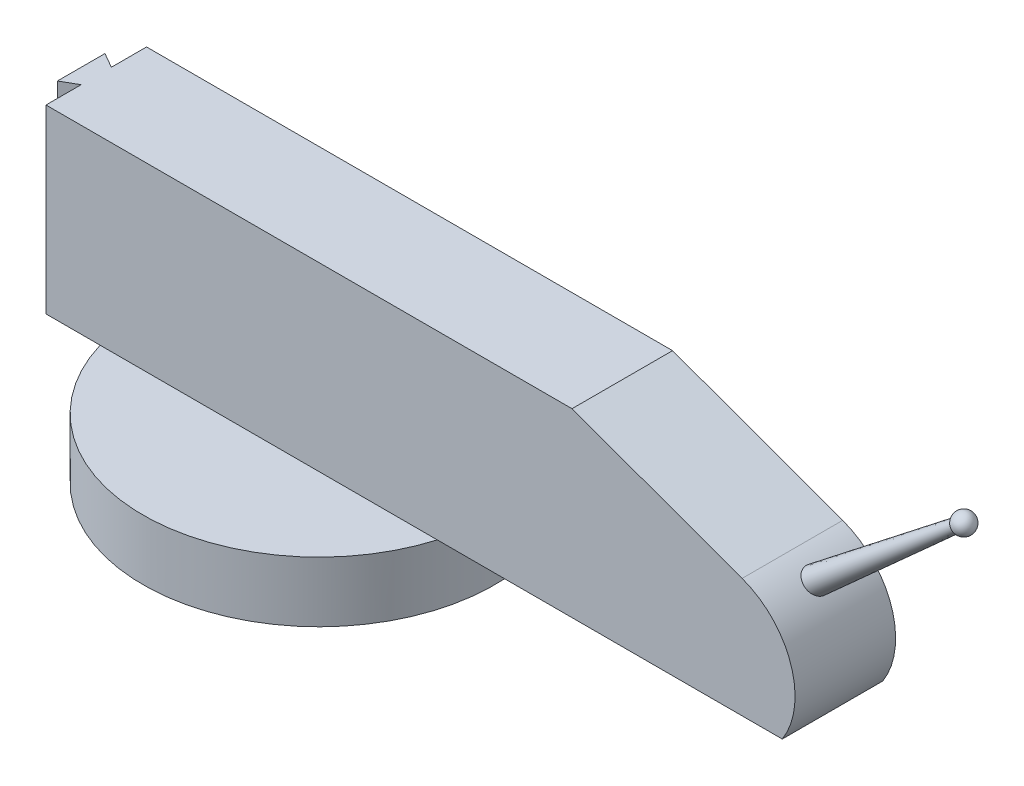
from build123d import *

# Parameters (mm, degrees)
EXTRUSION1_DEPTH        = 10
ENL_V_MAT_EXTRU_1_DEPTH = 79.74007874
ENL_V_MAT_EXTRU_2_DEPTH = 79.74007874
ESQUISSE4_R             = 1.25
EXTRUSION2_DEPTH        = 20
EXTRUSION2_TAPER        = 2
ESQUISSE6_R             = 17.5
EXTRUSION3_DEPTH        = 6


with BuildPart() as part:
    # Esquisse1 → Extrusion1 (new body)
    with BuildSketch(Plane.XY):
        with BuildLine():
            Line((0, 0), (0, 18))
            Line((0, 18), (53.817315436, 18))
            Line((53.817315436, 18), (70.736161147, 11.842043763))
            ThreePointArc((70.736161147, 11.842043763), (75.580407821, 6.881340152), (74.730429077, 0))
            Line((74.730429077, 0), (0, 0))
        make_face()
    extrude(amount=EXTRUSION1_DEPTH)

    # Esquisse2 → Enl_v. mat.-Extru.1 (cut, through all)
    with BuildSketch(Plane(origin=(0, 18, 0), x_dir=(-1, 0, 0), z_dir=(0, 1, 0))):
        Polygon((-1.5, 0), (-1.5, 3.5), (0, 2.633974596), (0, 0), align=None)
    extrude(amount=-ENL_V_MAT_EXTRU_1_DEPTH, mode=Mode.SUBTRACT)

    # Esquisse3 → Enl_v. mat.-Extru.2 (cut, through all)
    with BuildSketch(Plane(origin=(0, 18, 0), x_dir=(-1, 0, 0), z_dir=(0, 1, 0))):
        Polygon((-1.5, 10), (-1.5, 6.5), (0, 7.366025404), (0, 10), align=None)
    extrude(amount=-ENL_V_MAT_EXTRU_2_DEPTH, mode=Mode.SUBTRACT)

    # Esquisse4 → Extrusion2 (add)
    with BuildSketch(Plane(origin=(47.340751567, 39.72360718, 0), x_dir=(0, 0, -1), z_dir=(0.7660444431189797, 0.6427876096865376, 0))):
        with Locations((-5, -39.035793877)):
            Circle(ESQUISSE4_R)
    extrude(amount=EXTRUSION2_DEPTH, taper=EXTRUSION2_TAPER)

    # Esquisse6 → Extrusion3 (add)
    with BuildSketch(Plane.XZ):
        with Locations(Location((23.647334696, 5, 0), (0, 0, 163.398450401))):
            Circle(ESQUISSE6_R)
    extrude(amount=EXTRUSION3_DEPTH)

    # Esquisse7 → R_volution3 (revolve)
    with BuildSketch(Plane.XY.offset(5)):
        with BuildLine():
            Line((87.125483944, 23.392287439), (88.44249316, 21.88713405))
            ThreePointArc((88.44249316, 21.88713405), (88.536565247, 23.298215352), (87.125483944, 23.392287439))
        make_face()
    revolve(axis=Axis((88.44249316, 21.88713405, 5), (-0.6585046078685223, 0.7525766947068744, 0)))


solid = part.part
